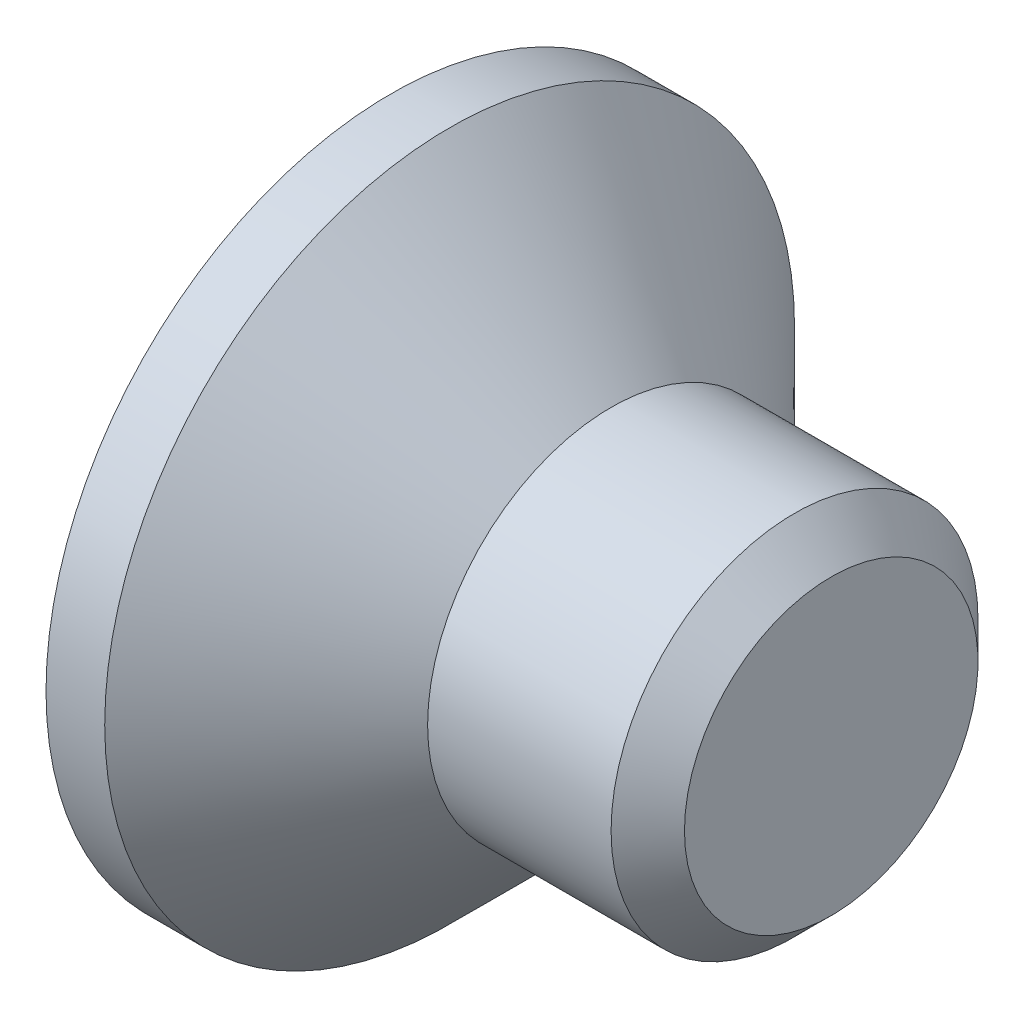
ISO-10303-21;
HEADER;
FILE_DESCRIPTION(('STEP AP214'),'2;1');
FILE_NAME('part.step','',(''),(''),'','','');
FILE_SCHEMA(('AUTOMOTIVE_DESIGN { 1 0 10303 214 1 1 1 1 }'));
ENDSEC;
DATA;
#1=APPLICATION_CONTEXT('core data for automotive mechanical design processes');
#2=APPLICATION_PROTOCOL_DEFINITION('international standard','automotive_design',2000,#1);
#3=PRODUCT_CONTEXT('',#1,'mechanical');
#4=PRODUCT('Part','Part','',(#3));
#5=PRODUCT_RELATED_PRODUCT_CATEGORY('part','',(#4));
#6=PRODUCT_DEFINITION_FORMATION('','',#4);
#7=PRODUCT_DEFINITION_CONTEXT('part definition',#1,'design');
#8=PRODUCT_DEFINITION('design','',#6,#7);
#9=PRODUCT_DEFINITION_SHAPE('','',#8);
#10=(LENGTH_UNIT() NAMED_UNIT(*) SI_UNIT(.MILLI.,.METRE.));
#11=(NAMED_UNIT(*) PLANE_ANGLE_UNIT() SI_UNIT($,.RADIAN.));
#12=(NAMED_UNIT(*) SI_UNIT($,.STERADIAN.) SOLID_ANGLE_UNIT());
#13=UNCERTAINTY_MEASURE_WITH_UNIT(LENGTH_MEASURE(1.E-05),#10,'distance_accuracy_value','');
#14=(GEOMETRIC_REPRESENTATION_CONTEXT(3) GLOBAL_UNCERTAINTY_ASSIGNED_CONTEXT((#13)) GLOBAL_UNIT_ASSIGNED_CONTEXT((#10,
#11,#12)) REPRESENTATION_CONTEXT('',''));
#15=CARTESIAN_POINT('',(0.,0.,0.));
#16=DIRECTION('',(0.,0.,1.));
#17=DIRECTION('',(1.,0.,0.));
#18=AXIS2_PLACEMENT_3D('',#15,#16,#17);
#19=CARTESIAN_POINT('',(0.,0.,0.));
#20=DIRECTION('',(-1.,0.,0.));
#21=DIRECTION('',(0.,0.,1.));
#22=AXIS2_PLACEMENT_3D('',#19,#20,#21);
#23=CONICAL_SURFACE('',#22,1.25,0.78539816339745);
#24=CARTESIAN_POINT('',(-1.1,0.,0.));
#25=DIRECTION('',(-1.,0.,0.));
#26=DIRECTION('',(0.,0.,1.));
#27=AXIS2_PLACEMENT_3D('',#24,#25,#26);
#28=CIRCLE('',#27,2.35);
#29=CARTESIAN_POINT('',(-1.1,0.,2.35));
#30=VERTEX_POINT('',#29);
#31=EDGE_CURVE('E189',#30,#30,#28,.T.);
#32=ORIENTED_EDGE('',*,*,#31,.F.);
#33=EDGE_LOOP('',(#32));
#34=FACE_BOUND('',#33,.T.);
#35=CARTESIAN_POINT('',(0.,0.,0.));
#36=DIRECTION('',(-1.,0.,0.));
#37=DIRECTION('',(0.,0.,1.));
#38=AXIS2_PLACEMENT_3D('',#35,#36,#37);
#39=CIRCLE('',#38,1.25);
#40=CARTESIAN_POINT('',(0.,0.,1.25));
#41=VERTEX_POINT('',#40);
#42=EDGE_CURVE('E212',#41,#41,#39,.T.);
#43=ORIENTED_EDGE('',*,*,#42,.T.);
#44=EDGE_LOOP('',(#43));
#45=FACE_BOUND('',#44,.T.);
#46=ADVANCED_FACE('F33',(#34,#45),#23,.T.);
#47=CARTESIAN_POINT('',(-1.5,0.,0.));
#48=DIRECTION('',(-1.,0.,0.));
#49=DIRECTION('',(0.,0.,1.));
#50=AXIS2_PLACEMENT_3D('',#47,#48,#49);
#51=CYLINDRICAL_SURFACE('',#50,1.25);
#52=CARTESIAN_POINT('',(1.25,0.,0.));
#53=DIRECTION('',(-1.,0.,0.));
#54=DIRECTION('',(0.,0.,1.));
#55=AXIS2_PLACEMENT_3D('',#52,#53,#54);
#56=CIRCLE('',#55,1.25);
#57=CARTESIAN_POINT('',(1.25,0.,1.25));
#58=VERTEX_POINT('',#57);
#59=EDGE_CURVE('E41',#58,#58,#56,.T.);
#60=ORIENTED_EDGE('',*,*,#59,.T.);
#61=EDGE_LOOP('',(#60));
#62=FACE_BOUND('',#61,.T.);
#63=ORIENTED_EDGE('',*,*,#42,.F.);
#64=EDGE_LOOP('',(#63));
#65=FACE_BOUND('',#64,.T.);
#66=ADVANCED_FACE('F217',(#62,#65),#51,.T.);
#67=CARTESIAN_POINT('',(1.5,0.,0.));
#68=DIRECTION('',(-1.,0.,0.));
#69=DIRECTION('',(0.,0.,1.));
#70=AXIS2_PLACEMENT_3D('',#67,#68,#69);
#71=PLANE('',#70);
#72=CARTESIAN_POINT('',(1.5,0.,0.));
#73=DIRECTION('',(-1.,0.,0.));
#74=DIRECTION('',(0.,0.,1.));
#75=AXIS2_PLACEMENT_3D('',#72,#73,#74);
#76=CIRCLE('',#75,0.999999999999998);
#77=CARTESIAN_POINT('',(1.5,0.,0.999999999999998));
#78=VERTEX_POINT('',#77);
#79=EDGE_CURVE('E11',#78,#78,#76,.F.);
#80=ORIENTED_EDGE('',*,*,#79,.T.);
#81=EDGE_LOOP('',(#80));
#82=FACE_BOUND('',#81,.T.);
#83=ADVANCED_FACE('F239',(#82),#71,.F.);
#84=CARTESIAN_POINT('',(-1.5,2.35,0.));
#85=DIRECTION('',(1.,0.,0.));
#86=DIRECTION('',(0.,0.,-1.));
#87=AXIS2_PLACEMENT_3D('',#84,#85,#86);
#88=PLANE('',#87);
#89=DIRECTION('',(0.,0.,-1.));
#90=VECTOR('',#89,1.);
#91=CARTESIAN_POINT('',(-1.5,0.34,-1.35));
#92=LINE('',#91,#90);
#93=CARTESIAN_POINT('',(-1.5,0.34,-0.34));
#94=VERTEX_POINT('',#93);
#95=CARTESIAN_POINT('',(-1.5,0.34,-1.35));
#96=VERTEX_POINT('',#95);
#97=EDGE_CURVE('E158',#94,#96,#92,.T.);
#98=ORIENTED_EDGE('',*,*,#97,.F.);
#99=DIRECTION('',(0.,-1.,0.));
#100=VECTOR('',#99,1.);
#101=CARTESIAN_POINT('',(-1.5,0.34,-0.34));
#102=LINE('',#101,#100);
#103=CARTESIAN_POINT('',(-1.5,1.35,-0.34));
#104=VERTEX_POINT('',#103);
#105=EDGE_CURVE('E48',#104,#94,#102,.T.);
#106=ORIENTED_EDGE('',*,*,#105,.F.);
#107=DIRECTION('',(0.,0.,-1.));
#108=VECTOR('',#107,1.);
#109=CARTESIAN_POINT('',(-1.5,1.35,-0.34));
#110=LINE('',#109,#108);
#111=CARTESIAN_POINT('',(-1.5,1.35,0.34));
#112=VERTEX_POINT('',#111);
#113=EDGE_CURVE('E185',#112,#104,#110,.T.);
#114=ORIENTED_EDGE('',*,*,#113,.F.);
#115=DIRECTION('',(0.,1.,0.));
#116=VECTOR('',#115,1.);
#117=CARTESIAN_POINT('',(-1.5,1.35,0.34));
#118=LINE('',#117,#116);
#119=CARTESIAN_POINT('',(-1.5,0.34,0.34));
#120=VERTEX_POINT('',#119);
#121=EDGE_CURVE('E183',#120,#112,#118,.T.);
#122=ORIENTED_EDGE('',*,*,#121,.F.);
#123=DIRECTION('',(0.,0.,-1.));
#124=VECTOR('',#123,1.);
#125=CARTESIAN_POINT('',(-1.5,0.34,0.34));
#126=LINE('',#125,#124);
#127=CARTESIAN_POINT('',(-1.5,0.34,1.35));
#128=VERTEX_POINT('',#127);
#129=EDGE_CURVE('E132',#128,#120,#126,.T.);
#130=ORIENTED_EDGE('',*,*,#129,.F.);
#131=DIRECTION('',(0.,1.,0.));
#132=VECTOR('',#131,1.);
#133=CARTESIAN_POINT('',(-1.5,0.34,1.35));
#134=LINE('',#133,#132);
#135=CARTESIAN_POINT('',(-1.5,-0.34,1.35));
#136=VERTEX_POINT('',#135);
#137=EDGE_CURVE('E179',#136,#128,#134,.T.);
#138=ORIENTED_EDGE('',*,*,#137,.F.);
#139=DIRECTION('',(0.,0.,1.));
#140=VECTOR('',#139,1.);
#141=CARTESIAN_POINT('',(-1.5,-0.34,1.35));
#142=LINE('',#141,#140);
#143=CARTESIAN_POINT('',(-1.5,-0.34,0.34));
#144=VERTEX_POINT('',#143);
#145=EDGE_CURVE('E176',#144,#136,#142,.T.);
#146=ORIENTED_EDGE('',*,*,#145,.F.);
#147=DIRECTION('',(0.,1.,0.));
#148=VECTOR('',#147,1.);
#149=CARTESIAN_POINT('',(-1.5,-0.34,0.34));
#150=LINE('',#149,#148);
#151=CARTESIAN_POINT('',(-1.5,-1.35,0.34));
#152=VERTEX_POINT('',#151);
#153=EDGE_CURVE('E173',#152,#144,#150,.T.);
#154=ORIENTED_EDGE('',*,*,#153,.F.);
#155=DIRECTION('',(0.,0.,1.));
#156=VECTOR('',#155,1.);
#157=CARTESIAN_POINT('',(-1.5,-1.35,0.34));
#158=LINE('',#157,#156);
#159=CARTESIAN_POINT('',(-1.5,-1.35,-0.34));
#160=VERTEX_POINT('',#159);
#161=EDGE_CURVE('E170',#160,#152,#158,.T.);
#162=ORIENTED_EDGE('',*,*,#161,.F.);
#163=DIRECTION('',(0.,-1.,0.));
#164=VECTOR('',#163,1.);
#165=CARTESIAN_POINT('',(-1.5,-1.35,-0.34));
#166=LINE('',#165,#164);
#167=CARTESIAN_POINT('',(-1.5,-0.34,-0.34));
#168=VERTEX_POINT('',#167);
#169=EDGE_CURVE('E167',#168,#160,#166,.T.);
#170=ORIENTED_EDGE('',*,*,#169,.F.);
#171=DIRECTION('',(0.,0.,1.));
#172=VECTOR('',#171,1.);
#173=CARTESIAN_POINT('',(-1.5,-0.34,-0.34));
#174=LINE('',#173,#172);
#175=CARTESIAN_POINT('',(-1.5,-0.34,-1.35));
#176=VERTEX_POINT('',#175);
#177=EDGE_CURVE('E164',#176,#168,#174,.T.);
#178=ORIENTED_EDGE('',*,*,#177,.F.);
#179=DIRECTION('',(0.,-1.,0.));
#180=VECTOR('',#179,1.);
#181=CARTESIAN_POINT('',(-1.5,-0.34,-1.35));
#182=LINE('',#181,#180);
#183=EDGE_CURVE('E161',#96,#176,#182,.T.);
#184=ORIENTED_EDGE('',*,*,#183,.F.);
#185=EDGE_LOOP('',(#98,#106,#114,#122,#130,#138,#146,#154,#162,#170,#178,#184));
#186=FACE_BOUND('',#185,.T.);
#187=CARTESIAN_POINT('',(-1.5,0.,0.));
#188=DIRECTION('',(-1.,0.,0.));
#189=DIRECTION('',(0.,0.,1.));
#190=AXIS2_PLACEMENT_3D('',#187,#188,#189);
#191=CIRCLE('',#190,2.35);
#192=CARTESIAN_POINT('',(-1.5,0.,2.35));
#193=VERTEX_POINT('',#192);
#194=EDGE_CURVE('E209',#193,#193,#191,.T.);
#195=ORIENTED_EDGE('',*,*,#194,.T.);
#196=EDGE_LOOP('',(#195));
#197=FACE_BOUND('',#196,.T.);
#198=ADVANCED_FACE('F230',(#186,#197),#88,.F.);
#199=CARTESIAN_POINT('',(-1.5,0.,0.));
#200=DIRECTION('',(-1.,0.,0.));
#201=DIRECTION('',(0.,0.,1.));
#202=AXIS2_PLACEMENT_3D('',#199,#200,#201);
#203=CYLINDRICAL_SURFACE('',#202,2.35);
#204=ORIENTED_EDGE('',*,*,#194,.F.);
#205=EDGE_LOOP('',(#204));
#206=FACE_BOUND('',#205,.T.);
#207=ORIENTED_EDGE('',*,*,#31,.T.);
#208=EDGE_LOOP('',(#207));
#209=FACE_BOUND('',#208,.T.);
#210=ADVANCED_FACE('F222',(#206,#209),#203,.T.);
#211=CARTESIAN_POINT('',(1.25,0.,0.));
#212=DIRECTION('',(-1.,0.,0.));
#213=DIRECTION('',(0.,0.,1.));
#214=AXIS2_PLACEMENT_3D('',#211,#212,#213);
#215=CONICAL_SURFACE('',#214,1.25,0.78539816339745);
#216=ORIENTED_EDGE('',*,*,#79,.F.);
#217=EDGE_LOOP('',(#216));
#218=FACE_BOUND('',#217,.T.);
#219=ORIENTED_EDGE('',*,*,#59,.F.);
#220=EDGE_LOOP('',(#219));
#221=FACE_BOUND('',#220,.T.);
#222=ADVANCED_FACE('F35',(#218,#221),#215,.T.);
#223=CARTESIAN_POINT('',(-0.25,0.34,-0.34));
#224=DIRECTION('',(0.,0.,-1.));
#225=DIRECTION('',(-1.,0.,0.));
#226=AXIS2_PLACEMENT_3D('',#223,#224,#225);
#227=PLANE('',#226);
#228=ORIENTED_EDGE('',*,*,#105,.T.);
#229=DIRECTION('',(-1.,0.,0.));
#230=VECTOR('',#229,1.);
#231=CARTESIAN_POINT('',(-0.25,0.34,-0.34));
#232=LINE('',#231,#230);
#233=CARTESIAN_POINT('',(-0.25,0.34,-0.34));
#234=VERTEX_POINT('',#233);
#235=EDGE_CURVE('E96',#234,#94,#232,.T.);
#236=ORIENTED_EDGE('',*,*,#235,.F.);
#237=DIRECTION('',(0.,-1.,0.));
#238=VECTOR('',#237,1.);
#239=CARTESIAN_POINT('',(-0.25,0.34,-0.34));
#240=LINE('',#239,#238);
#241=CARTESIAN_POINT('',(-0.25,1.35,-0.34));
#242=VERTEX_POINT('',#241);
#243=EDGE_CURVE('E187',#242,#234,#240,.T.);
#244=ORIENTED_EDGE('',*,*,#243,.F.);
#245=DIRECTION('',(-1.,0.,0.));
#246=VECTOR('',#245,1.);
#247=CARTESIAN_POINT('',(-0.25,1.35,-0.34));
#248=LINE('',#247,#246);
#249=EDGE_CURVE('E56',#242,#104,#248,.T.);
#250=ORIENTED_EDGE('',*,*,#249,.T.);
#251=EDGE_LOOP('',(#228,#236,#244,#250));
#252=FACE_BOUND('',#251,.T.);
#253=ADVANCED_FACE('F221',(#252),#227,.F.);
#254=CARTESIAN_POINT('',(-0.25,1.35,-0.34));
#255=DIRECTION('',(0.,1.,0.));
#256=DIRECTION('',(-1.,0.,0.));
#257=AXIS2_PLACEMENT_3D('',#254,#255,#256);
#258=PLANE('',#257);
#259=ORIENTED_EDGE('',*,*,#113,.T.);
#260=ORIENTED_EDGE('',*,*,#249,.F.);
#261=DIRECTION('',(0.,0.,-1.));
#262=VECTOR('',#261,1.);
#263=CARTESIAN_POINT('',(-0.25,1.35,-0.34));
#264=LINE('',#263,#262);
#265=CARTESIAN_POINT('',(-0.25,1.35,0.34));
#266=VERTEX_POINT('',#265);
#267=EDGE_CURVE('E144',#266,#242,#264,.T.);
#268=ORIENTED_EDGE('',*,*,#267,.F.);
#269=DIRECTION('',(-1.,0.,0.));
#270=VECTOR('',#269,1.);
#271=CARTESIAN_POINT('',(-0.25,1.35,0.34));
#272=LINE('',#271,#270);
#273=EDGE_CURVE('E136',#266,#112,#272,.T.);
#274=ORIENTED_EDGE('',*,*,#273,.T.);
#275=EDGE_LOOP('',(#259,#260,#268,#274));
#276=FACE_BOUND('',#275,.T.);
#277=ADVANCED_FACE('F228',(#276),#258,.F.);
#278=CARTESIAN_POINT('',(-0.25,1.35,0.34));
#279=DIRECTION('',(0.,0.,1.));
#280=DIRECTION('',(1.,0.,0.));
#281=AXIS2_PLACEMENT_3D('',#278,#279,#280);
#282=PLANE('',#281);
#283=ORIENTED_EDGE('',*,*,#121,.T.);
#284=ORIENTED_EDGE('',*,*,#273,.F.);
#285=DIRECTION('',(0.,1.,0.));
#286=VECTOR('',#285,1.);
#287=CARTESIAN_POINT('',(-0.25,1.35,0.34));
#288=LINE('',#287,#286);
#289=CARTESIAN_POINT('',(-0.25,0.34,0.34));
#290=VERTEX_POINT('',#289);
#291=EDGE_CURVE('E140',#290,#266,#288,.T.);
#292=ORIENTED_EDGE('',*,*,#291,.F.);
#293=DIRECTION('',(-1.,0.,0.));
#294=VECTOR('',#293,1.);
#295=CARTESIAN_POINT('',(-0.25,0.34,0.34));
#296=LINE('',#295,#294);
#297=EDGE_CURVE('E125',#290,#120,#296,.T.);
#298=ORIENTED_EDGE('',*,*,#297,.T.);
#299=EDGE_LOOP('',(#283,#284,#292,#298));
#300=FACE_BOUND('',#299,.T.);
#301=ADVANCED_FACE('F141',(#300),#282,.F.);
#302=CARTESIAN_POINT('',(-0.25,0.34,0.34));
#303=DIRECTION('',(0.,1.,0.));
#304=DIRECTION('',(-1.,0.,0.));
#305=AXIS2_PLACEMENT_3D('',#302,#303,#304);
#306=PLANE('',#305);
#307=ORIENTED_EDGE('',*,*,#129,.T.);
#308=ORIENTED_EDGE('',*,*,#297,.F.);
#309=DIRECTION('',(0.,0.,-1.));
#310=VECTOR('',#309,1.);
#311=CARTESIAN_POINT('',(-0.25,0.34,0.34));
#312=LINE('',#311,#310);
#313=CARTESIAN_POINT('',(-0.25,0.34,1.35));
#314=VERTEX_POINT('',#313);
#315=EDGE_CURVE('E129',#314,#290,#312,.T.);
#316=ORIENTED_EDGE('',*,*,#315,.F.);
#317=DIRECTION('',(-1.,0.,0.));
#318=VECTOR('',#317,1.);
#319=CARTESIAN_POINT('',(-0.25,0.34,1.35));
#320=LINE('',#319,#318);
#321=EDGE_CURVE('E137',#314,#128,#320,.T.);
#322=ORIENTED_EDGE('',*,*,#321,.T.);
#323=EDGE_LOOP('',(#307,#308,#316,#322));
#324=FACE_BOUND('',#323,.T.);
#325=ADVANCED_FACE('F127',(#324),#306,.F.);
#326=CARTESIAN_POINT('',(-0.25,0.34,1.35));
#327=DIRECTION('',(0.,0.,1.));
#328=DIRECTION('',(1.,0.,0.));
#329=AXIS2_PLACEMENT_3D('',#326,#327,#328);
#330=PLANE('',#329);
#331=ORIENTED_EDGE('',*,*,#137,.T.);
#332=ORIENTED_EDGE('',*,*,#321,.F.);
#333=DIRECTION('',(0.,1.,0.));
#334=VECTOR('',#333,1.);
#335=CARTESIAN_POINT('',(-0.25,0.34,1.35));
#336=LINE('',#335,#334);
#337=CARTESIAN_POINT('',(-0.25,-0.34,1.35));
#338=VERTEX_POINT('',#337);
#339=EDGE_CURVE('E150',#338,#314,#336,.T.);
#340=ORIENTED_EDGE('',*,*,#339,.F.);
#341=DIRECTION('',(-1.,0.,0.));
#342=VECTOR('',#341,1.);
#343=CARTESIAN_POINT('',(-0.25,-0.34,1.35));
#344=LINE('',#343,#342);
#345=EDGE_CURVE('E192',#338,#136,#344,.T.);
#346=ORIENTED_EDGE('',*,*,#345,.T.);
#347=EDGE_LOOP('',(#331,#332,#340,#346));
#348=FACE_BOUND('',#347,.T.);
#349=ADVANCED_FACE('F277',(#348),#330,.F.);
#350=CARTESIAN_POINT('',(-0.25,-0.34,1.35));
#351=DIRECTION('',(0.,-1.,0.));
#352=DIRECTION('',(1.,0.,0.));
#353=AXIS2_PLACEMENT_3D('',#350,#351,#352);
#354=PLANE('',#353);
#355=ORIENTED_EDGE('',*,*,#145,.T.);
#356=ORIENTED_EDGE('',*,*,#345,.F.);
#357=DIRECTION('',(0.,0.,1.));
#358=VECTOR('',#357,1.);
#359=CARTESIAN_POINT('',(-0.25,-0.34,1.35));
#360=LINE('',#359,#358);
#361=CARTESIAN_POINT('',(-0.25,-0.34,0.34));
#362=VERTEX_POINT('',#361);
#363=EDGE_CURVE('E152',#362,#338,#360,.T.);
#364=ORIENTED_EDGE('',*,*,#363,.F.);
#365=DIRECTION('',(-1.,0.,0.));
#366=VECTOR('',#365,1.);
#367=CARTESIAN_POINT('',(-0.25,-0.34,0.34));
#368=LINE('',#367,#366);
#369=EDGE_CURVE('E194',#362,#144,#368,.T.);
#370=ORIENTED_EDGE('',*,*,#369,.T.);
#371=EDGE_LOOP('',(#355,#356,#364,#370));
#372=FACE_BOUND('',#371,.T.);
#373=ADVANCED_FACE('F273',(#372),#354,.F.);
#374=CARTESIAN_POINT('',(-0.25,-0.34,0.34));
#375=DIRECTION('',(0.,0.,1.));
#376=DIRECTION('',(1.,0.,0.));
#377=AXIS2_PLACEMENT_3D('',#374,#375,#376);
#378=PLANE('',#377);
#379=ORIENTED_EDGE('',*,*,#153,.T.);
#380=ORIENTED_EDGE('',*,*,#369,.F.);
#381=DIRECTION('',(0.,1.,0.));
#382=VECTOR('',#381,1.);
#383=CARTESIAN_POINT('',(-0.25,-0.34,0.34));
#384=LINE('',#383,#382);
#385=CARTESIAN_POINT('',(-0.25,-1.35,0.34));
#386=VERTEX_POINT('',#385);
#387=EDGE_CURVE('E422',#386,#362,#384,.T.);
#388=ORIENTED_EDGE('',*,*,#387,.F.);
#389=DIRECTION('',(-1.,0.,0.));
#390=VECTOR('',#389,1.);
#391=CARTESIAN_POINT('',(-0.25,-1.35,0.34));
#392=LINE('',#391,#390);
#393=EDGE_CURVE('E196',#386,#152,#392,.T.);
#394=ORIENTED_EDGE('',*,*,#393,.T.);
#395=EDGE_LOOP('',(#379,#380,#388,#394));
#396=FACE_BOUND('',#395,.T.);
#397=ADVANCED_FACE('F269',(#396),#378,.F.);
#398=CARTESIAN_POINT('',(-0.25,-1.35,0.34));
#399=DIRECTION('',(0.,-1.,0.));
#400=DIRECTION('',(1.,0.,0.));
#401=AXIS2_PLACEMENT_3D('',#398,#399,#400);
#402=PLANE('',#401);
#403=ORIENTED_EDGE('',*,*,#161,.T.);
#404=ORIENTED_EDGE('',*,*,#393,.F.);
#405=DIRECTION('',(0.,0.,1.));
#406=VECTOR('',#405,1.);
#407=CARTESIAN_POINT('',(-0.25,-1.35,0.34));
#408=LINE('',#407,#406);
#409=CARTESIAN_POINT('',(-0.25,-1.35,-0.34));
#410=VERTEX_POINT('',#409);
#411=EDGE_CURVE('E419',#410,#386,#408,.T.);
#412=ORIENTED_EDGE('',*,*,#411,.F.);
#413=DIRECTION('',(-1.,0.,0.));
#414=VECTOR('',#413,1.);
#415=CARTESIAN_POINT('',(-0.25,-1.35,-0.34));
#416=LINE('',#415,#414);
#417=EDGE_CURVE('E198',#410,#160,#416,.T.);
#418=ORIENTED_EDGE('',*,*,#417,.T.);
#419=EDGE_LOOP('',(#403,#404,#412,#418));
#420=FACE_BOUND('',#419,.T.);
#421=ADVANCED_FACE('F265',(#420),#402,.F.);
#422=CARTESIAN_POINT('',(-0.25,-1.35,-0.34));
#423=DIRECTION('',(0.,0.,-1.));
#424=DIRECTION('',(-1.,0.,0.));
#425=AXIS2_PLACEMENT_3D('',#422,#423,#424);
#426=PLANE('',#425);
#427=ORIENTED_EDGE('',*,*,#169,.T.);
#428=ORIENTED_EDGE('',*,*,#417,.F.);
#429=DIRECTION('',(0.,-1.,0.));
#430=VECTOR('',#429,1.);
#431=CARTESIAN_POINT('',(-0.25,-1.35,-0.34));
#432=LINE('',#431,#430);
#433=CARTESIAN_POINT('',(-0.25,-0.34,-0.34));
#434=VERTEX_POINT('',#433);
#435=EDGE_CURVE('E416',#434,#410,#432,.T.);
#436=ORIENTED_EDGE('',*,*,#435,.F.);
#437=DIRECTION('',(-1.,0.,0.));
#438=VECTOR('',#437,1.);
#439=CARTESIAN_POINT('',(-0.25,-0.34,-0.34));
#440=LINE('',#439,#438);
#441=EDGE_CURVE('E200',#434,#168,#440,.T.);
#442=ORIENTED_EDGE('',*,*,#441,.T.);
#443=EDGE_LOOP('',(#427,#428,#436,#442));
#444=FACE_BOUND('',#443,.T.);
#445=ADVANCED_FACE('F261',(#444),#426,.F.);
#446=CARTESIAN_POINT('',(-0.25,-0.34,-0.34));
#447=DIRECTION('',(0.,-1.,0.));
#448=DIRECTION('',(1.,0.,0.));
#449=AXIS2_PLACEMENT_3D('',#446,#447,#448);
#450=PLANE('',#449);
#451=ORIENTED_EDGE('',*,*,#177,.T.);
#452=ORIENTED_EDGE('',*,*,#441,.F.);
#453=DIRECTION('',(0.,0.,1.));
#454=VECTOR('',#453,1.);
#455=CARTESIAN_POINT('',(-0.25,-0.34,-0.34));
#456=LINE('',#455,#454);
#457=CARTESIAN_POINT('',(-0.25,-0.34,-1.35));
#458=VERTEX_POINT('',#457);
#459=EDGE_CURVE('E413',#458,#434,#456,.T.);
#460=ORIENTED_EDGE('',*,*,#459,.F.);
#461=DIRECTION('',(-1.,0.,0.));
#462=VECTOR('',#461,1.);
#463=CARTESIAN_POINT('',(-0.25,-0.34,-1.35));
#464=LINE('',#463,#462);
#465=EDGE_CURVE('E202',#458,#176,#464,.T.);
#466=ORIENTED_EDGE('',*,*,#465,.T.);
#467=EDGE_LOOP('',(#451,#452,#460,#466));
#468=FACE_BOUND('',#467,.T.);
#469=ADVANCED_FACE('F257',(#468),#450,.F.);
#470=CARTESIAN_POINT('',(-0.25,-0.34,-1.35));
#471=DIRECTION('',(0.,0.,-1.));
#472=DIRECTION('',(-1.,0.,0.));
#473=AXIS2_PLACEMENT_3D('',#470,#471,#472);
#474=PLANE('',#473);
#475=ORIENTED_EDGE('',*,*,#183,.T.);
#476=ORIENTED_EDGE('',*,*,#465,.F.);
#477=DIRECTION('',(0.,-1.,0.));
#478=VECTOR('',#477,1.);
#479=CARTESIAN_POINT('',(-0.25,-0.34,-1.35));
#480=LINE('',#479,#478);
#481=CARTESIAN_POINT('',(-0.25,0.34,-1.35));
#482=VERTEX_POINT('',#481);
#483=EDGE_CURVE('E408',#482,#458,#480,.T.);
#484=ORIENTED_EDGE('',*,*,#483,.F.);
#485=DIRECTION('',(-1.,0.,0.));
#486=VECTOR('',#485,1.);
#487=CARTESIAN_POINT('',(-0.25,0.34,-1.35));
#488=LINE('',#487,#486);
#489=EDGE_CURVE('E204',#482,#96,#488,.T.);
#490=ORIENTED_EDGE('',*,*,#489,.T.);
#491=EDGE_LOOP('',(#475,#476,#484,#490));
#492=FACE_BOUND('',#491,.T.);
#493=ADVANCED_FACE('F253',(#492),#474,.F.);
#494=CARTESIAN_POINT('',(-0.25,0.34,-1.35));
#495=DIRECTION('',(0.,1.,0.));
#496=DIRECTION('',(-1.,0.,0.));
#497=AXIS2_PLACEMENT_3D('',#494,#495,#496);
#498=PLANE('',#497);
#499=ORIENTED_EDGE('',*,*,#97,.T.);
#500=ORIENTED_EDGE('',*,*,#489,.F.);
#501=DIRECTION('',(0.,0.,-1.));
#502=VECTOR('',#501,1.);
#503=CARTESIAN_POINT('',(-0.25,0.34,-1.35));
#504=LINE('',#503,#502);
#505=EDGE_CURVE('E406',#234,#482,#504,.T.);
#506=ORIENTED_EDGE('',*,*,#505,.F.);
#507=ORIENTED_EDGE('',*,*,#235,.T.);
#508=EDGE_LOOP('',(#499,#500,#506,#507));
#509=FACE_BOUND('',#508,.T.);
#510=ADVANCED_FACE('F250',(#509),#498,.F.);
#511=CARTESIAN_POINT('',(-0.25,0.,0.));
#512=DIRECTION('',(1.,0.,0.));
#513=DIRECTION('',(0.,0.,-1.));
#514=AXIS2_PLACEMENT_3D('',#511,#512,#513);
#515=PLANE('',#514);
#516=ORIENTED_EDGE('',*,*,#243,.T.);
#517=ORIENTED_EDGE('',*,*,#505,.T.);
#518=ORIENTED_EDGE('',*,*,#483,.T.);
#519=ORIENTED_EDGE('',*,*,#459,.T.);
#520=ORIENTED_EDGE('',*,*,#435,.T.);
#521=ORIENTED_EDGE('',*,*,#411,.T.);
#522=ORIENTED_EDGE('',*,*,#387,.T.);
#523=ORIENTED_EDGE('',*,*,#363,.T.);
#524=ORIENTED_EDGE('',*,*,#339,.T.);
#525=ORIENTED_EDGE('',*,*,#315,.T.);
#526=ORIENTED_EDGE('',*,*,#291,.T.);
#527=ORIENTED_EDGE('',*,*,#267,.T.);
#528=EDGE_LOOP('',(#516,#517,#518,#519,#520,#521,#522,#523,#524,#525,#526,#527));
#529=FACE_BOUND('',#528,.T.);
#530=ADVANCED_FACE('F147',(#529),#515,.F.);
#531=CLOSED_SHELL('',(#46,#66,#83,#198,#210,#222,#253,#277,#301,#325,#349,#373,#397,#421,#445,
#469,#493,#510,#530));
#532=MANIFOLD_SOLID_BREP('B2',#531);
#533=ADVANCED_BREP_SHAPE_REPRESENTATION('',(#18,#532),#14);
#534=SHAPE_DEFINITION_REPRESENTATION(#9,#533);
ENDSEC;
END-ISO-10303-21;
